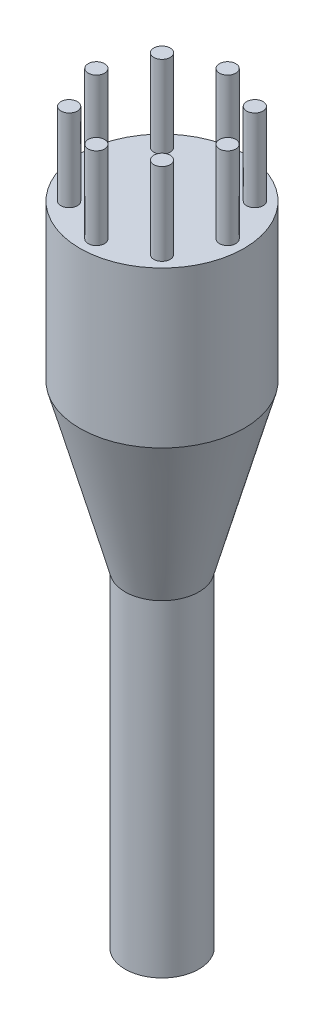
ISO-10303-21;
HEADER;
FILE_DESCRIPTION(('STEP AP214'),'2;1');
FILE_NAME('part.step','',(''),(''),'','','');
FILE_SCHEMA(('AUTOMOTIVE_DESIGN { 1 0 10303 214 1 1 1 1 }'));
ENDSEC;
DATA;
#1=APPLICATION_CONTEXT('core data for automotive mechanical design processes');
#2=APPLICATION_PROTOCOL_DEFINITION('international standard','automotive_design',2000,#1);
#3=PRODUCT_CONTEXT('',#1,'mechanical');
#4=PRODUCT('Part','Part','',(#3));
#5=PRODUCT_RELATED_PRODUCT_CATEGORY('part','',(#4));
#6=PRODUCT_DEFINITION_FORMATION('','',#4);
#7=PRODUCT_DEFINITION_CONTEXT('part definition',#1,'design');
#8=PRODUCT_DEFINITION('design','',#6,#7);
#9=PRODUCT_DEFINITION_SHAPE('','',#8);
#10=(LENGTH_UNIT() NAMED_UNIT(*) SI_UNIT(.MILLI.,.METRE.));
#11=(NAMED_UNIT(*) PLANE_ANGLE_UNIT() SI_UNIT($,.RADIAN.));
#12=(NAMED_UNIT(*) SI_UNIT($,.STERADIAN.) SOLID_ANGLE_UNIT());
#13=UNCERTAINTY_MEASURE_WITH_UNIT(LENGTH_MEASURE(1.E-05),#10,'distance_accuracy_value','');
#14=(GEOMETRIC_REPRESENTATION_CONTEXT(3) GLOBAL_UNCERTAINTY_ASSIGNED_CONTEXT((#13)) GLOBAL_UNIT_ASSIGNED_CONTEXT((#10,
#11,#12)) REPRESENTATION_CONTEXT('',''));
#15=CARTESIAN_POINT('',(0.,0.,0.));
#16=DIRECTION('',(0.,0.,1.));
#17=DIRECTION('',(1.,0.,0.));
#18=AXIS2_PLACEMENT_3D('',#15,#16,#17);
#19=CARTESIAN_POINT('',(0.,19.,0.));
#20=DIRECTION('',(0.,1.,0.));
#21=DIRECTION('',(0.,0.,1.));
#22=AXIS2_PLACEMENT_3D('',#19,#20,#21);
#23=PLANE('',#22);
#24=CARTESIAN_POINT('',(-8.,19.,0.));
#25=DIRECTION('',(0.,1.,0.));
#26=DIRECTION('',(1.,0.,0.));
#27=AXIS2_PLACEMENT_3D('',#24,#25,#26);
#28=CIRCLE('',#27,1.);
#29=CARTESIAN_POINT('',(-7.,19.,0.));
#30=VERTEX_POINT('',#29);
#31=EDGE_CURVE('E82',#30,#30,#28,.T.);
#32=ORIENTED_EDGE('',*,*,#31,.F.);
#33=EDGE_LOOP('',(#32));
#34=FACE_BOUND('',#33,.T.);
#35=CARTESIAN_POINT('',(0.,19.,8.));
#36=DIRECTION('',(0.,1.,0.));
#37=DIRECTION('',(0.,0.,-1.));
#38=AXIS2_PLACEMENT_3D('',#35,#36,#37);
#39=CIRCLE('',#38,1.);
#40=CARTESIAN_POINT('',(0.,19.,7.));
#41=VERTEX_POINT('',#40);
#42=EDGE_CURVE('E70',#41,#41,#39,.T.);
#43=ORIENTED_EDGE('',*,*,#42,.F.);
#44=EDGE_LOOP('',(#43));
#45=FACE_BOUND('',#44,.T.);
#46=CARTESIAN_POINT('',(8.,19.,0.));
#47=DIRECTION('',(0.,1.,0.));
#48=DIRECTION('',(-1.,0.,0.));
#49=AXIS2_PLACEMENT_3D('',#46,#47,#48);
#50=CIRCLE('',#49,1.);
#51=CARTESIAN_POINT('',(7.,19.,0.));
#52=VERTEX_POINT('',#51);
#53=EDGE_CURVE('E58',#52,#52,#50,.T.);
#54=ORIENTED_EDGE('',*,*,#53,.F.);
#55=EDGE_LOOP('',(#54));
#56=FACE_BOUND('',#55,.T.);
#57=CARTESIAN_POINT('',(0.,19.,-8.));
#58=DIRECTION('',(0.,1.,0.));
#59=DIRECTION('',(0.,0.,1.));
#60=AXIS2_PLACEMENT_3D('',#57,#58,#59);
#61=CIRCLE('',#60,1.);
#62=CARTESIAN_POINT('',(0.,19.,-7.));
#63=VERTEX_POINT('',#62);
#64=EDGE_CURVE('E43',#63,#63,#61,.T.);
#65=ORIENTED_EDGE('',*,*,#64,.F.);
#66=EDGE_LOOP('',(#65));
#67=FACE_BOUND('',#66,.T.);
#68=CARTESIAN_POINT('',(0.,19.,0.));
#69=DIRECTION('',(0.,1.,0.));
#70=DIRECTION('',(0.,0.,1.));
#71=AXIS2_PLACEMENT_3D('',#68,#69,#70);
#72=CIRCLE('',#71,10.);
#73=CARTESIAN_POINT('',(0.,19.,10.));
#74=VERTEX_POINT('',#73);
#75=EDGE_CURVE('E10',#74,#74,#72,.T.);
#76=ORIENTED_EDGE('',*,*,#75,.T.);
#77=EDGE_LOOP('',(#76));
#78=FACE_BOUND('',#77,.T.);
#79=CARTESIAN_POINT('',(5.65685424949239,19.,-5.65685424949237));
#80=DIRECTION('',(0.,1.,0.));
#81=DIRECTION('',(-0.707106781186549,0.,0.707106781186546));
#82=AXIS2_PLACEMENT_3D('',#79,#80,#81);
#83=CIRCLE('',#82,1.);
#84=CARTESIAN_POINT('',(4.94974746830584,19.,-4.94974746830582));
#85=VERTEX_POINT('',#84);
#86=EDGE_CURVE('E52',#85,#85,#83,.T.);
#87=ORIENTED_EDGE('',*,*,#86,.F.);
#88=EDGE_LOOP('',(#87));
#89=FACE_BOUND('',#88,.T.);
#90=CARTESIAN_POINT('',(5.65685424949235,19.,5.65685424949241));
#91=DIRECTION('',(0.,1.,0.));
#92=DIRECTION('',(-0.707106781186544,0.,-0.707106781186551));
#93=AXIS2_PLACEMENT_3D('',#90,#91,#92);
#94=CIRCLE('',#93,1.);
#95=CARTESIAN_POINT('',(4.94974746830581,19.,4.94974746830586));
#96=VERTEX_POINT('',#95);
#97=EDGE_CURVE('E64',#96,#96,#94,.T.);
#98=ORIENTED_EDGE('',*,*,#97,.F.);
#99=EDGE_LOOP('',(#98));
#100=FACE_BOUND('',#99,.T.);
#101=CARTESIAN_POINT('',(-5.65685424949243,19.,5.65685424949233));
#102=DIRECTION('',(0.,1.,0.));
#103=DIRECTION('',(0.707106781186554,0.,-0.707106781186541));
#104=AXIS2_PLACEMENT_3D('',#101,#102,#103);
#105=CIRCLE('',#104,1.);
#106=CARTESIAN_POINT('',(-4.94974746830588,19.,4.94974746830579));
#107=VERTEX_POINT('',#106);
#108=EDGE_CURVE('E76',#107,#107,#105,.T.);
#109=ORIENTED_EDGE('',*,*,#108,.F.);
#110=EDGE_LOOP('',(#109));
#111=FACE_BOUND('',#110,.T.);
#112=CARTESIAN_POINT('',(-5.65685424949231,19.,-5.65685424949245));
#113=DIRECTION('',(0.,1.,0.));
#114=DIRECTION('',(0.707106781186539,0.,0.707106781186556));
#115=AXIS2_PLACEMENT_3D('',#112,#113,#114);
#116=CIRCLE('',#115,1.);
#117=CARTESIAN_POINT('',(-4.94974746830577,19.,-4.94974746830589));
#118=VERTEX_POINT('',#117);
#119=EDGE_CURVE('E88',#118,#118,#116,.T.);
#120=ORIENTED_EDGE('',*,*,#119,.F.);
#121=EDGE_LOOP('',(#120));
#122=FACE_BOUND('',#121,.T.);
#123=ADVANCED_FACE('F32',(#34,#45,#56,#67,#78,#89,#100,#111,#122),#23,.T.);
#124=CARTESIAN_POINT('',(0.,19.,0.));
#125=DIRECTION('',(0.,-1.,0.));
#126=DIRECTION('',(0.,0.,-1.));
#127=AXIS2_PLACEMENT_3D('',#124,#125,#126);
#128=CYLINDRICAL_SURFACE('',#127,10.);
#129=ORIENTED_EDGE('',*,*,#75,.F.);
#130=EDGE_LOOP('',(#129));
#131=FACE_BOUND('',#130,.T.);
#132=CARTESIAN_POINT('',(0.,0.,0.));
#133=DIRECTION('',(0.,1.,0.));
#134=DIRECTION('',(0.,0.,1.));
#135=AXIS2_PLACEMENT_3D('',#132,#133,#134);
#136=CIRCLE('',#135,10.);
#137=CARTESIAN_POINT('',(0.,0.,10.));
#138=VERTEX_POINT('',#137);
#139=EDGE_CURVE('E97',#138,#138,#136,.T.);
#140=ORIENTED_EDGE('',*,*,#139,.T.);
#141=EDGE_LOOP('',(#140));
#142=FACE_BOUND('',#141,.T.);
#143=ADVANCED_FACE('F34',(#131,#142),#128,.T.);
#144=CARTESIAN_POINT('',(0.,29.,-8.));
#145=DIRECTION('',(0.,-1.,0.));
#146=DIRECTION('',(0.,0.,-1.));
#147=AXIS2_PLACEMENT_3D('',#144,#145,#146);
#148=CYLINDRICAL_SURFACE('',#147,1.);
#149=CARTESIAN_POINT('',(0.,29.,-8.));
#150=DIRECTION('',(0.,1.,0.));
#151=DIRECTION('',(0.,0.,1.));
#152=AXIS2_PLACEMENT_3D('',#149,#150,#151);
#153=CIRCLE('',#152,1.);
#154=CARTESIAN_POINT('',(0.,29.,-7.));
#155=VERTEX_POINT('',#154);
#156=EDGE_CURVE('E39',#155,#155,#153,.T.);
#157=ORIENTED_EDGE('',*,*,#156,.F.);
#158=EDGE_LOOP('',(#157));
#159=FACE_BOUND('',#158,.T.);
#160=ORIENTED_EDGE('',*,*,#64,.T.);
#161=EDGE_LOOP('',(#160));
#162=FACE_BOUND('',#161,.T.);
#163=ADVANCED_FACE('F118',(#159,#162),#148,.T.);
#164=CARTESIAN_POINT('',(0.,29.,-8.));
#165=DIRECTION('',(0.,1.,0.));
#166=DIRECTION('',(0.,0.,1.));
#167=AXIS2_PLACEMENT_3D('',#164,#165,#166);
#168=PLANE('',#167);
#169=ORIENTED_EDGE('',*,*,#156,.T.);
#170=EDGE_LOOP('',(#169));
#171=FACE_BOUND('',#170,.T.);
#172=ADVANCED_FACE('F125',(#171),#168,.T.);
#173=CARTESIAN_POINT('',(5.65685424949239,29.,-5.65685424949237));
#174=DIRECTION('',(0.,-1.,0.));
#175=DIRECTION('',(0.,0.,-1.));
#176=AXIS2_PLACEMENT_3D('',#173,#174,#175);
#177=CYLINDRICAL_SURFACE('',#176,1.);
#178=CARTESIAN_POINT('',(5.65685424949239,29.,-5.65685424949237));
#179=DIRECTION('',(0.,1.,0.));
#180=DIRECTION('',(-0.707106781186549,0.,0.707106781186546));
#181=AXIS2_PLACEMENT_3D('',#178,#179,#180);
#182=CIRCLE('',#181,1.);
#183=CARTESIAN_POINT('',(4.94974746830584,29.,-4.94974746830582));
#184=VERTEX_POINT('',#183);
#185=EDGE_CURVE('E47',#184,#184,#182,.T.);
#186=ORIENTED_EDGE('',*,*,#185,.F.);
#187=EDGE_LOOP('',(#186));
#188=FACE_BOUND('',#187,.T.);
#189=ORIENTED_EDGE('',*,*,#86,.T.);
#190=EDGE_LOOP('',(#189));
#191=FACE_BOUND('',#190,.T.);
#192=ADVANCED_FACE('F129',(#188,#191),#177,.T.);
#193=CARTESIAN_POINT('',(5.65685424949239,29.,-5.65685424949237));
#194=DIRECTION('',(0.,1.,0.));
#195=DIRECTION('',(-0.707106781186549,0.,0.707106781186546));
#196=AXIS2_PLACEMENT_3D('',#193,#194,#195);
#197=PLANE('',#196);
#198=ORIENTED_EDGE('',*,*,#185,.T.);
#199=EDGE_LOOP('',(#198));
#200=FACE_BOUND('',#199,.T.);
#201=ADVANCED_FACE('F132',(#200),#197,.T.);
#202=CARTESIAN_POINT('',(8.,29.,0.));
#203=DIRECTION('',(0.,-1.,0.));
#204=DIRECTION('',(0.,0.,-1.));
#205=AXIS2_PLACEMENT_3D('',#202,#203,#204);
#206=CYLINDRICAL_SURFACE('',#205,1.);
#207=CARTESIAN_POINT('',(8.,29.,0.));
#208=DIRECTION('',(0.,1.,0.));
#209=DIRECTION('',(-1.,0.,0.));
#210=AXIS2_PLACEMENT_3D('',#207,#208,#209);
#211=CIRCLE('',#210,1.);
#212=CARTESIAN_POINT('',(7.,29.,0.));
#213=VERTEX_POINT('',#212);
#214=EDGE_CURVE('E55',#213,#213,#211,.T.);
#215=ORIENTED_EDGE('',*,*,#214,.F.);
#216=EDGE_LOOP('',(#215));
#217=FACE_BOUND('',#216,.T.);
#218=ORIENTED_EDGE('',*,*,#53,.T.);
#219=EDGE_LOOP('',(#218));
#220=FACE_BOUND('',#219,.T.);
#221=ADVANCED_FACE('F136',(#217,#220),#206,.T.);
#222=CARTESIAN_POINT('',(8.,29.,0.));
#223=DIRECTION('',(0.,1.,0.));
#224=DIRECTION('',(-1.,0.,0.));
#225=AXIS2_PLACEMENT_3D('',#222,#223,#224);
#226=PLANE('',#225);
#227=ORIENTED_EDGE('',*,*,#214,.T.);
#228=EDGE_LOOP('',(#227));
#229=FACE_BOUND('',#228,.T.);
#230=ADVANCED_FACE('F140',(#229),#226,.T.);
#231=CARTESIAN_POINT('',(5.65685424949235,29.,5.65685424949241));
#232=DIRECTION('',(0.,-1.,0.));
#233=DIRECTION('',(0.,0.,-1.));
#234=AXIS2_PLACEMENT_3D('',#231,#232,#233);
#235=CYLINDRICAL_SURFACE('',#234,1.);
#236=CARTESIAN_POINT('',(5.65685424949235,29.,5.65685424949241));
#237=DIRECTION('',(0.,1.,0.));
#238=DIRECTION('',(-0.707106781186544,0.,-0.707106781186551));
#239=AXIS2_PLACEMENT_3D('',#236,#237,#238);
#240=CIRCLE('',#239,1.);
#241=CARTESIAN_POINT('',(4.94974746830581,29.,4.94974746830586));
#242=VERTEX_POINT('',#241);
#243=EDGE_CURVE('E61',#242,#242,#240,.T.);
#244=ORIENTED_EDGE('',*,*,#243,.F.);
#245=EDGE_LOOP('',(#244));
#246=FACE_BOUND('',#245,.T.);
#247=ORIENTED_EDGE('',*,*,#97,.T.);
#248=EDGE_LOOP('',(#247));
#249=FACE_BOUND('',#248,.T.);
#250=ADVANCED_FACE('F144',(#246,#249),#235,.T.);
#251=CARTESIAN_POINT('',(5.65685424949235,29.,5.65685424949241));
#252=DIRECTION('',(0.,1.,0.));
#253=DIRECTION('',(-0.707106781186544,0.,-0.707106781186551));
#254=AXIS2_PLACEMENT_3D('',#251,#252,#253);
#255=PLANE('',#254);
#256=ORIENTED_EDGE('',*,*,#243,.T.);
#257=EDGE_LOOP('',(#256));
#258=FACE_BOUND('',#257,.T.);
#259=ADVANCED_FACE('F148',(#258),#255,.T.);
#260=CARTESIAN_POINT('',(0.,29.,8.));
#261=DIRECTION('',(0.,-1.,0.));
#262=DIRECTION('',(0.,0.,-1.));
#263=AXIS2_PLACEMENT_3D('',#260,#261,#262);
#264=CYLINDRICAL_SURFACE('',#263,1.);
#265=CARTESIAN_POINT('',(0.,29.,8.));
#266=DIRECTION('',(0.,1.,0.));
#267=DIRECTION('',(0.,0.,-1.));
#268=AXIS2_PLACEMENT_3D('',#265,#266,#267);
#269=CIRCLE('',#268,1.);
#270=CARTESIAN_POINT('',(0.,29.,7.));
#271=VERTEX_POINT('',#270);
#272=EDGE_CURVE('E67',#271,#271,#269,.T.);
#273=ORIENTED_EDGE('',*,*,#272,.F.);
#274=EDGE_LOOP('',(#273));
#275=FACE_BOUND('',#274,.T.);
#276=ORIENTED_EDGE('',*,*,#42,.T.);
#277=EDGE_LOOP('',(#276));
#278=FACE_BOUND('',#277,.T.);
#279=ADVANCED_FACE('F152',(#275,#278),#264,.T.);
#280=CARTESIAN_POINT('',(0.,29.,8.));
#281=DIRECTION('',(0.,1.,0.));
#282=DIRECTION('',(0.,0.,-1.));
#283=AXIS2_PLACEMENT_3D('',#280,#281,#282);
#284=PLANE('',#283);
#285=ORIENTED_EDGE('',*,*,#272,.T.);
#286=EDGE_LOOP('',(#285));
#287=FACE_BOUND('',#286,.T.);
#288=ADVANCED_FACE('F156',(#287),#284,.T.);
#289=CARTESIAN_POINT('',(-5.65685424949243,29.,5.65685424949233));
#290=DIRECTION('',(0.,-1.,0.));
#291=DIRECTION('',(0.,0.,-1.));
#292=AXIS2_PLACEMENT_3D('',#289,#290,#291);
#293=CYLINDRICAL_SURFACE('',#292,1.);
#294=CARTESIAN_POINT('',(-5.65685424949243,29.,5.65685424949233));
#295=DIRECTION('',(0.,1.,0.));
#296=DIRECTION('',(0.707106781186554,0.,-0.707106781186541));
#297=AXIS2_PLACEMENT_3D('',#294,#295,#296);
#298=CIRCLE('',#297,1.);
#299=CARTESIAN_POINT('',(-4.94974746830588,29.,4.94974746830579));
#300=VERTEX_POINT('',#299);
#301=EDGE_CURVE('E73',#300,#300,#298,.T.);
#302=ORIENTED_EDGE('',*,*,#301,.F.);
#303=EDGE_LOOP('',(#302));
#304=FACE_BOUND('',#303,.T.);
#305=ORIENTED_EDGE('',*,*,#108,.T.);
#306=EDGE_LOOP('',(#305));
#307=FACE_BOUND('',#306,.T.);
#308=ADVANCED_FACE('F160',(#304,#307),#293,.T.);
#309=CARTESIAN_POINT('',(-5.65685424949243,29.,5.65685424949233));
#310=DIRECTION('',(0.,1.,0.));
#311=DIRECTION('',(0.707106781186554,0.,-0.707106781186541));
#312=AXIS2_PLACEMENT_3D('',#309,#310,#311);
#313=PLANE('',#312);
#314=ORIENTED_EDGE('',*,*,#301,.T.);
#315=EDGE_LOOP('',(#314));
#316=FACE_BOUND('',#315,.T.);
#317=ADVANCED_FACE('F164',(#316),#313,.T.);
#318=CARTESIAN_POINT('',(-8.,29.,0.));
#319=DIRECTION('',(0.,-1.,0.));
#320=DIRECTION('',(0.,0.,-1.));
#321=AXIS2_PLACEMENT_3D('',#318,#319,#320);
#322=CYLINDRICAL_SURFACE('',#321,1.);
#323=CARTESIAN_POINT('',(-8.,29.,0.));
#324=DIRECTION('',(0.,1.,0.));
#325=DIRECTION('',(1.,0.,0.));
#326=AXIS2_PLACEMENT_3D('',#323,#324,#325);
#327=CIRCLE('',#326,1.);
#328=CARTESIAN_POINT('',(-7.,29.,0.));
#329=VERTEX_POINT('',#328);
#330=EDGE_CURVE('E79',#329,#329,#327,.T.);
#331=ORIENTED_EDGE('',*,*,#330,.F.);
#332=EDGE_LOOP('',(#331));
#333=FACE_BOUND('',#332,.T.);
#334=ORIENTED_EDGE('',*,*,#31,.T.);
#335=EDGE_LOOP('',(#334));
#336=FACE_BOUND('',#335,.T.);
#337=ADVANCED_FACE('F168',(#333,#336),#322,.T.);
#338=CARTESIAN_POINT('',(-8.,29.,0.));
#339=DIRECTION('',(0.,1.,0.));
#340=DIRECTION('',(1.,0.,0.));
#341=AXIS2_PLACEMENT_3D('',#338,#339,#340);
#342=PLANE('',#341);
#343=ORIENTED_EDGE('',*,*,#330,.T.);
#344=EDGE_LOOP('',(#343));
#345=FACE_BOUND('',#344,.T.);
#346=ADVANCED_FACE('F172',(#345),#342,.T.);
#347=CARTESIAN_POINT('',(-5.65685424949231,29.,-5.65685424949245));
#348=DIRECTION('',(0.,-1.,0.));
#349=DIRECTION('',(0.,0.,-1.));
#350=AXIS2_PLACEMENT_3D('',#347,#348,#349);
#351=CYLINDRICAL_SURFACE('',#350,1.);
#352=CARTESIAN_POINT('',(-5.65685424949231,29.,-5.65685424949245));
#353=DIRECTION('',(0.,1.,0.));
#354=DIRECTION('',(0.707106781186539,0.,0.707106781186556));
#355=AXIS2_PLACEMENT_3D('',#352,#353,#354);
#356=CIRCLE('',#355,1.);
#357=CARTESIAN_POINT('',(-4.94974746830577,29.,-4.94974746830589));
#358=VERTEX_POINT('',#357);
#359=EDGE_CURVE('E85',#358,#358,#356,.T.);
#360=ORIENTED_EDGE('',*,*,#359,.F.);
#361=EDGE_LOOP('',(#360));
#362=FACE_BOUND('',#361,.T.);
#363=ORIENTED_EDGE('',*,*,#119,.T.);
#364=EDGE_LOOP('',(#363));
#365=FACE_BOUND('',#364,.T.);
#366=ADVANCED_FACE('F176',(#362,#365),#351,.T.);
#367=CARTESIAN_POINT('',(-5.65685424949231,29.,-5.65685424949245));
#368=DIRECTION('',(0.,1.,0.));
#369=DIRECTION('',(0.707106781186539,0.,0.707106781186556));
#370=AXIS2_PLACEMENT_3D('',#367,#368,#369);
#371=PLANE('',#370);
#372=ORIENTED_EDGE('',*,*,#359,.T.);
#373=EDGE_LOOP('',(#372));
#374=FACE_BOUND('',#373,.T.);
#375=ADVANCED_FACE('F180',(#374),#371,.T.);
#376=CARTESIAN_POINT('',(0.,-59.8168469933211,4.49999999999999));
#377=DIRECTION('',(0.,-1.,0.));
#378=DIRECTION('',(0.,0.,-1.));
#379=AXIS2_PLACEMENT_3D('',#376,#377,#378);
#380=PLANE('',#379);
#381=CARTESIAN_POINT('',(0.,-59.8168469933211,0.));
#382=DIRECTION('',(0.,1.,0.));
#383=DIRECTION('',(0.,0.,1.));
#384=AXIS2_PLACEMENT_3D('',#381,#382,#383);
#385=CIRCLE('',#384,4.49999999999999);
#386=CARTESIAN_POINT('',(0.,-59.8168469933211,4.49999999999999));
#387=VERTEX_POINT('',#386);
#388=EDGE_CURVE('E91',#387,#387,#385,.T.);
#389=ORIENTED_EDGE('',*,*,#388,.F.);
#390=EDGE_LOOP('',(#389));
#391=FACE_BOUND('',#390,.T.);
#392=ADVANCED_FACE('F110',(#391),#380,.T.);
#393=CARTESIAN_POINT('',(0.,73.4978723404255,0.));
#394=DIRECTION('',(0.,1.,0.));
#395=DIRECTION('',(0.,0.,1.));
#396=AXIS2_PLACEMENT_3D('',#393,#394,#395);
#397=CYLINDRICAL_SURFACE('',#396,4.5);
#398=ORIENTED_EDGE('',*,*,#388,.T.);
#399=EDGE_LOOP('',(#398));
#400=FACE_BOUND('',#399,.T.);
#401=CARTESIAN_POINT('',(0.,-20.,0.));
#402=DIRECTION('',(0.,1.,0.));
#403=DIRECTION('',(0.,0.,1.));
#404=AXIS2_PLACEMENT_3D('',#401,#402,#403);
#405=CIRCLE('',#404,4.5);
#406=CARTESIAN_POINT('',(0.,-20.,4.5));
#407=VERTEX_POINT('',#406);
#408=EDGE_CURVE('E94',#407,#407,#405,.T.);
#409=ORIENTED_EDGE('',*,*,#408,.F.);
#410=EDGE_LOOP('',(#409));
#411=FACE_BOUND('',#410,.T.);
#412=ADVANCED_FACE('F104',(#400,#411),#397,.T.);
#413=CARTESIAN_POINT('',(0.,0.,0.));
#414=DIRECTION('',(0.,1.,0.));
#415=DIRECTION('',(0.,0.,1.));
#416=AXIS2_PLACEMENT_3D('',#413,#414,#415);
#417=CONICAL_SURFACE('',#416,10.,0.268366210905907);
#418=ORIENTED_EDGE('',*,*,#408,.T.);
#419=EDGE_LOOP('',(#418));
#420=FACE_BOUND('',#419,.T.);
#421=ORIENTED_EDGE('',*,*,#139,.F.);
#422=EDGE_LOOP('',(#421));
#423=FACE_BOUND('',#422,.T.);
#424=ADVANCED_FACE('F102',(#420,#423),#417,.T.);
#425=CLOSED_SHELL('',(#123,#143,#163,#172,#192,#201,#221,#230,#250,#259,#279,#288,#308,#317,
#337,#346,#366,#375,#392,#412,#424));
#426=MANIFOLD_SOLID_BREP('B2',#425);
#427=ADVANCED_BREP_SHAPE_REPRESENTATION('',(#18,#426),#14);
#428=SHAPE_DEFINITION_REPRESENTATION(#9,#427);
ENDSEC;
END-ISO-10303-21;
